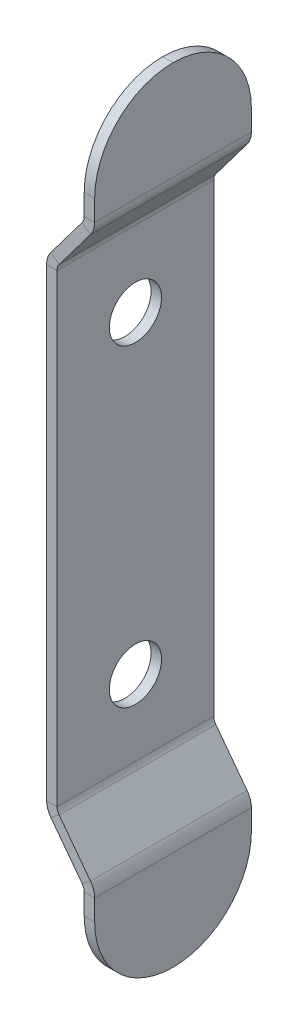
ISO-10303-21;
HEADER;
FILE_DESCRIPTION(('STEP AP214'),'2;1');
FILE_NAME('part.step','',(''),(''),'','','');
FILE_SCHEMA(('AUTOMOTIVE_DESIGN { 1 0 10303 214 1 1 1 1 }'));
ENDSEC;
DATA;
#1=APPLICATION_CONTEXT('core data for automotive mechanical design processes');
#2=APPLICATION_PROTOCOL_DEFINITION('international standard','automotive_design',2000,#1);
#3=PRODUCT_CONTEXT('',#1,'mechanical');
#4=PRODUCT('Part','Part','',(#3));
#5=PRODUCT_RELATED_PRODUCT_CATEGORY('part','',(#4));
#6=PRODUCT_DEFINITION_FORMATION('','',#4);
#7=PRODUCT_DEFINITION_CONTEXT('part definition',#1,'design');
#8=PRODUCT_DEFINITION('design','',#6,#7);
#9=PRODUCT_DEFINITION_SHAPE('','',#8);
#10=(LENGTH_UNIT() NAMED_UNIT(*) SI_UNIT(.MILLI.,.METRE.));
#11=(NAMED_UNIT(*) PLANE_ANGLE_UNIT() SI_UNIT($,.RADIAN.));
#12=(NAMED_UNIT(*) SI_UNIT($,.STERADIAN.) SOLID_ANGLE_UNIT());
#13=UNCERTAINTY_MEASURE_WITH_UNIT(LENGTH_MEASURE(1.E-05),#10,'distance_accuracy_value','');
#14=(GEOMETRIC_REPRESENTATION_CONTEXT(3) GLOBAL_UNCERTAINTY_ASSIGNED_CONTEXT((#13)) GLOBAL_UNIT_ASSIGNED_CONTEXT((#10,
#11,#12)) REPRESENTATION_CONTEXT('',''));
#15=CARTESIAN_POINT('',(0.,0.,0.));
#16=DIRECTION('',(0.,0.,1.));
#17=DIRECTION('',(1.,0.,0.));
#18=AXIS2_PLACEMENT_3D('',#15,#16,#17);
#19=CARTESIAN_POINT('',(-6.48170725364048,5.5,1.5));
#20=DIRECTION('',(0.,0.,-1.));
#21=DIRECTION('',(-1.,0.,0.));
#22=AXIS2_PLACEMENT_3D('',#19,#20,#21);
#23=PLANE('',#22);
#24=DIRECTION('',(0.,1.,0.));
#25=VECTOR('',#24,1.);
#26=CARTESIAN_POINT('',(0.82,5.49999999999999,1.5));
#27=LINE('',#26,#25);
#28=CARTESIAN_POINT('',(0.82,5.60037859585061,1.49999999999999));
#29=VERTEX_POINT('',#28);
#30=CARTESIAN_POINT('',(0.82,5.99999999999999,1.5));
#31=VERTEX_POINT('',#30);
#32=EDGE_CURVE('E419',#29,#31,#27,.T.);
#33=ORIENTED_EDGE('',*,*,#32,.T.);
#34=DIRECTION('',(1.,0.,0.));
#35=VECTOR('',#34,1.);
#36=CARTESIAN_POINT('',(-6.48170725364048,6.,1.5));
#37=LINE('',#36,#35);
#38=CARTESIAN_POINT('',(0.62,5.99999999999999,1.5));
#39=VERTEX_POINT('',#38);
#40=EDGE_CURVE('E219',#31,#39,#37,.F.);
#41=ORIENTED_EDGE('',*,*,#40,.T.);
#42=DIRECTION('',(0.,1.,0.));
#43=VECTOR('',#42,1.);
#44=CARTESIAN_POINT('',(0.62,5.49999999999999,1.5));
#45=LINE('',#44,#43);
#46=CARTESIAN_POINT('',(0.619999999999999,5.60037859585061,1.5));
#47=VERTEX_POINT('',#46);
#48=EDGE_CURVE('E194',#47,#39,#45,.T.);
#49=ORIENTED_EDGE('',*,*,#48,.F.);
#50=DIRECTION('',(1.,0.,0.));
#51=VECTOR('',#50,1.);
#52=CARTESIAN_POINT('',(-6.48170725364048,5.60037859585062,1.49999999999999));
#53=LINE('',#52,#51);
#54=EDGE_CURVE('E204',#47,#29,#53,.T.);
#55=ORIENTED_EDGE('',*,*,#54,.T.);
#56=EDGE_LOOP('',(#33,#41,#49,#55));
#57=FACE_BOUND('',#56,.T.);
#58=ADVANCED_FACE('F24',(#57),#23,.F.);
#59=CARTESIAN_POINT('',(-6.48170725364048,5.50000000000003,-1.5));
#60=DIRECTION('',(0.,0.,-1.));
#61=DIRECTION('',(-1.,0.,0.));
#62=AXIS2_PLACEMENT_3D('',#59,#60,#61);
#63=PLANE('',#62);
#64=DIRECTION('',(0.,1.,0.));
#65=VECTOR('',#64,1.);
#66=CARTESIAN_POINT('',(0.62,5.50000000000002,-1.5));
#67=LINE('',#66,#65);
#68=CARTESIAN_POINT('',(0.619999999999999,5.60037859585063,-1.5));
#69=VERTEX_POINT('',#68);
#70=CARTESIAN_POINT('',(0.62,6.00000000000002,-1.5));
#71=VERTEX_POINT('',#70);
#72=EDGE_CURVE('E197',#69,#71,#67,.T.);
#73=ORIENTED_EDGE('',*,*,#72,.T.);
#74=DIRECTION('',(1.,0.,0.));
#75=VECTOR('',#74,1.);
#76=CARTESIAN_POINT('',(0.82,6.00000000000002,-1.5));
#77=LINE('',#76,#75);
#78=CARTESIAN_POINT('',(0.82,6.00000000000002,-1.5));
#79=VERTEX_POINT('',#78);
#80=EDGE_CURVE('E225',#71,#79,#77,.T.);
#81=ORIENTED_EDGE('',*,*,#80,.T.);
#82=DIRECTION('',(0.,1.,0.));
#83=VECTOR('',#82,1.);
#84=CARTESIAN_POINT('',(0.82,5.50000000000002,-1.5));
#85=LINE('',#84,#83);
#86=CARTESIAN_POINT('',(0.819999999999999,5.60037859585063,-1.5));
#87=VERTEX_POINT('',#86);
#88=EDGE_CURVE('E203',#87,#79,#85,.T.);
#89=ORIENTED_EDGE('',*,*,#88,.F.);
#90=DIRECTION('',(1.,0.,0.));
#91=VECTOR('',#90,1.);
#92=CARTESIAN_POINT('',(-6.48170725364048,5.60037859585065,-1.50000000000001));
#93=LINE('',#92,#91);
#94=EDGE_CURVE('E176',#69,#87,#93,.T.);
#95=ORIENTED_EDGE('',*,*,#94,.F.);
#96=EDGE_LOOP('',(#73,#81,#89,#95));
#97=FACE_BOUND('',#96,.T.);
#98=ADVANCED_FACE('F207',(#97),#63,.T.);
#99=CARTESIAN_POINT('',(0.62,5.49999999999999,1.5));
#100=DIRECTION('',(-1.,0.,0.));
#101=DIRECTION('',(0.,-1.,0.));
#102=AXIS2_PLACEMENT_3D('',#99,#100,#101);
#103=PLANE('',#102);
#104=ORIENTED_EDGE('',*,*,#48,.T.);
#105=CARTESIAN_POINT('',(0.62,6.,0.));
#106=DIRECTION('',(-1.,0.,0.));
#107=DIRECTION('',(0.,-1.,0.));
#108=AXIS2_PLACEMENT_3D('',#105,#106,#107);
#109=CIRCLE('',#108,1.5);
#110=CARTESIAN_POINT('',(0.62,7.5,0.));
#111=VERTEX_POINT('',#110);
#112=EDGE_CURVE('E223',#39,#111,#109,.T.);
#113=ORIENTED_EDGE('',*,*,#112,.T.);
#114=CARTESIAN_POINT('',(0.62,6.,0.));
#115=DIRECTION('',(-1.,0.,0.));
#116=DIRECTION('',(0.,-1.,0.));
#117=AXIS2_PLACEMENT_3D('',#114,#115,#116);
#118=CIRCLE('',#117,1.5);
#119=EDGE_CURVE('E200',#111,#71,#118,.T.);
#120=ORIENTED_EDGE('',*,*,#119,.T.);
#121=ORIENTED_EDGE('',*,*,#72,.F.);
#122=DIRECTION('',(0.,0.,-1.));
#123=VECTOR('',#122,1.);
#124=CARTESIAN_POINT('',(0.62,5.60037859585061,1.49999999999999));
#125=LINE('',#124,#123);
#126=EDGE_CURVE('E187',#47,#69,#125,.T.);
#127=ORIENTED_EDGE('',*,*,#126,.F.);
#128=EDGE_LOOP('',(#104,#113,#120,#121,#127));
#129=FACE_BOUND('',#128,.T.);
#130=ADVANCED_FACE('F198',(#129),#103,.T.);
#131=CARTESIAN_POINT('',(0.82,5.49999999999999,1.5));
#132=DIRECTION('',(-1.,0.,0.));
#133=DIRECTION('',(0.,-1.,0.));
#134=AXIS2_PLACEMENT_3D('',#131,#132,#133);
#135=PLANE('',#134);
#136=CARTESIAN_POINT('',(0.82,6.,0.));
#137=DIRECTION('',(-1.,0.,0.));
#138=DIRECTION('',(0.,-1.,0.));
#139=AXIS2_PLACEMENT_3D('',#136,#137,#138);
#140=CIRCLE('',#139,1.5);
#141=CARTESIAN_POINT('',(0.82,7.5,0.));
#142=VERTEX_POINT('',#141);
#143=EDGE_CURVE('E215',#79,#142,#140,.F.);
#144=ORIENTED_EDGE('',*,*,#143,.T.);
#145=CARTESIAN_POINT('',(0.82,6.,0.));
#146=DIRECTION('',(-1.,0.,0.));
#147=DIRECTION('',(0.,-1.,0.));
#148=AXIS2_PLACEMENT_3D('',#145,#146,#147);
#149=CIRCLE('',#148,1.5);
#150=EDGE_CURVE('E217',#142,#31,#149,.F.);
#151=ORIENTED_EDGE('',*,*,#150,.T.);
#152=ORIENTED_EDGE('',*,*,#32,.F.);
#153=DIRECTION('',(0.,0.,-1.));
#154=VECTOR('',#153,1.);
#155=CARTESIAN_POINT('',(0.82,5.60037859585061,1.49999999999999));
#156=LINE('',#155,#154);
#157=EDGE_CURVE('E422',#29,#87,#156,.T.);
#158=ORIENTED_EDGE('',*,*,#157,.T.);
#159=ORIENTED_EDGE('',*,*,#88,.T.);
#160=EDGE_LOOP('',(#144,#151,#152,#158,#159));
#161=FACE_BOUND('',#160,.T.);
#162=ADVANCED_FACE('F435',(#161),#135,.F.);
#163=CARTESIAN_POINT('',(5.68894479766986,1.75563152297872,1.5));
#164=DIRECTION('',(0.,0.,1.));
#165=DIRECTION('',(0.798635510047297,-0.601815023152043,0.));
#166=AXIS2_PLACEMENT_3D('',#163,#164,#165);
#167=PLANE('',#166);
#168=DIRECTION('',(-0.798635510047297,0.601815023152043,0.));
#169=VECTOR('',#168,1.);
#170=CARTESIAN_POINT('',(5.62853545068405,1.67546561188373,1.5));
#171=LINE('',#170,#169);
#172=CARTESIAN_POINT('',(0.73945420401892,5.35965258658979,1.5));
#173=VERTEX_POINT('',#172);
#174=CARTESIAN_POINT('',(0.579727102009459,5.4800155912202,1.5));
#175=VERTEX_POINT('',#174);
#176=EDGE_CURVE('E411',#173,#175,#171,.T.);
#177=ORIENTED_EDGE('',*,*,#176,.T.);
#178=DIRECTION('',(0.601815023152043,0.798635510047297,0.));
#179=VECTOR('',#178,1.);
#180=CARTESIAN_POINT('',(0.64013644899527,5.56018150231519,1.49999999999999));
#181=LINE('',#180,#179);
#182=CARTESIAN_POINT('',(-0.0194542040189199,4.68487514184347,1.5));
#183=VERTEX_POINT('',#182);
#184=EDGE_CURVE('E389',#183,#175,#181,.T.);
#185=ORIENTED_EDGE('',*,*,#184,.F.);
#186=DIRECTION('',(-0.798635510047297,0.601815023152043,0.));
#187=VECTOR('',#186,1.);
#188=CARTESIAN_POINT('',(5.02935414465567,0.880325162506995,1.5));
#189=LINE('',#188,#187);
#190=CARTESIAN_POINT('',(0.14027289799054,4.56451213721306,1.5));
#191=VERTEX_POINT('',#190);
#192=EDGE_CURVE('E409',#191,#183,#189,.T.);
#193=ORIENTED_EDGE('',*,*,#192,.F.);
#194=DIRECTION('',(0.601815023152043,0.798635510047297,0.));
#195=VECTOR('',#194,1.);
#196=CARTESIAN_POINT('',(0.799863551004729,5.43981849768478,1.5));
#197=LINE('',#196,#195);
#198=EDGE_CURVE('E397',#191,#173,#197,.T.);
#199=ORIENTED_EDGE('',*,*,#198,.T.);
#200=EDGE_LOOP('',(#177,#185,#193,#199));
#201=FACE_BOUND('',#200,.T.);
#202=ADVANCED_FACE('F447',(#201),#167,.T.);
#203=CARTESIAN_POINT('',(5.68894479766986,1.75563152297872,-1.5));
#204=DIRECTION('',(0.,0.,1.));
#205=DIRECTION('',(0.798635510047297,-0.601815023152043,0.));
#206=AXIS2_PLACEMENT_3D('',#203,#204,#205);
#207=PLANE('',#206);
#208=DIRECTION('',(-0.601815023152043,-0.798635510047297,0.));
#209=VECTOR('',#208,1.);
#210=CARTESIAN_POINT('',(0.64013644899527,5.56018150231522,-1.50000000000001));
#211=LINE('',#210,#209);
#212=CARTESIAN_POINT('',(0.579727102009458,5.48001559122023,-1.5));
#213=VERTEX_POINT('',#212);
#214=CARTESIAN_POINT('',(-0.0194542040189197,4.6848751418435,-1.5));
#215=VERTEX_POINT('',#214);
#216=EDGE_CURVE('E416',#213,#215,#211,.T.);
#217=ORIENTED_EDGE('',*,*,#216,.F.);
#218=DIRECTION('',(-0.798635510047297,0.601815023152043,0.));
#219=VECTOR('',#218,1.);
#220=CARTESIAN_POINT('',(5.62853545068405,1.67546561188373,-1.5));
#221=LINE('',#220,#219);
#222=CARTESIAN_POINT('',(0.739454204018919,5.35965258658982,-1.5));
#223=VERTEX_POINT('',#222);
#224=EDGE_CURVE('E179',#223,#213,#221,.T.);
#225=ORIENTED_EDGE('',*,*,#224,.F.);
#226=DIRECTION('',(-0.601815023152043,-0.798635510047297,0.));
#227=VECTOR('',#226,1.);
#228=CARTESIAN_POINT('',(0.799863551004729,5.43981849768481,-1.5));
#229=LINE('',#228,#227);
#230=CARTESIAN_POINT('',(0.14027289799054,4.56451213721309,-1.5));
#231=VERTEX_POINT('',#230);
#232=EDGE_CURVE('E413',#223,#231,#229,.T.);
#233=ORIENTED_EDGE('',*,*,#232,.T.);
#234=DIRECTION('',(-0.798635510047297,0.601815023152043,0.));
#235=VECTOR('',#234,1.);
#236=CARTESIAN_POINT('',(5.02935414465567,0.880325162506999,-1.5));
#237=LINE('',#236,#235);
#238=EDGE_CURVE('E406',#231,#215,#237,.T.);
#239=ORIENTED_EDGE('',*,*,#238,.T.);
#240=EDGE_LOOP('',(#217,#225,#233,#239));
#241=FACE_BOUND('',#240,.T.);
#242=ADVANCED_FACE('F476',(#241),#207,.F.);
#243=CARTESIAN_POINT('',(0.799863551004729,5.43981849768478,1.5));
#244=DIRECTION('',(-0.798635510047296,0.601815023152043,0.));
#245=DIRECTION('',(-0.601815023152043,-0.798635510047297,0.));
#246=AXIS2_PLACEMENT_3D('',#243,#244,#245);
#247=PLANE('',#246);
#248=ORIENTED_EDGE('',*,*,#232,.F.);
#249=DIRECTION('',(0.,0.,1.));
#250=VECTOR('',#249,1.);
#251=CARTESIAN_POINT('',(0.739454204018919,5.35965258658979,1.5));
#252=LINE('',#251,#250);
#253=EDGE_CURVE('E403',#223,#173,#252,.T.);
#254=ORIENTED_EDGE('',*,*,#253,.T.);
#255=ORIENTED_EDGE('',*,*,#198,.F.);
#256=DIRECTION('',(0.,0.,-1.));
#257=VECTOR('',#256,1.);
#258=CARTESIAN_POINT('',(0.14027289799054,4.5645121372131,-1.5));
#259=LINE('',#258,#257);
#260=EDGE_CURVE('E400',#191,#231,#259,.T.);
#261=ORIENTED_EDGE('',*,*,#260,.T.);
#262=EDGE_LOOP('',(#248,#254,#255,#261));
#263=FACE_BOUND('',#262,.T.);
#264=ADVANCED_FACE('F443',(#263),#247,.F.);
#265=CARTESIAN_POINT('',(0.64013644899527,5.56018150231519,1.49999999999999));
#266=DIRECTION('',(-0.798635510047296,0.601815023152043,0.));
#267=DIRECTION('',(-0.601815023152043,-0.798635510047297,0.));
#268=AXIS2_PLACEMENT_3D('',#265,#266,#267);
#269=PLANE('',#268);
#270=DIRECTION('',(0.,0.,1.));
#271=VECTOR('',#270,1.);
#272=CARTESIAN_POINT('',(0.579727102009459,5.4800155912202,1.5));
#273=LINE('',#272,#271);
#274=EDGE_CURVE('E395',#213,#175,#273,.T.);
#275=ORIENTED_EDGE('',*,*,#274,.F.);
#276=ORIENTED_EDGE('',*,*,#216,.T.);
#277=DIRECTION('',(0.,0.,-1.));
#278=VECTOR('',#277,1.);
#279=CARTESIAN_POINT('',(-0.0194542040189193,4.6848751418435,-1.5));
#280=LINE('',#279,#278);
#281=EDGE_CURVE('E392',#183,#215,#280,.T.);
#282=ORIENTED_EDGE('',*,*,#281,.F.);
#283=ORIENTED_EDGE('',*,*,#184,.T.);
#284=EDGE_LOOP('',(#275,#276,#282,#283));
#285=FACE_BOUND('',#284,.T.);
#286=ADVANCED_FACE('F482',(#285),#269,.T.);
#287=CARTESIAN_POINT('',(-6.48170725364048,-5.49999999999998,-1.5));
#288=DIRECTION('',(0.,0.,-1.));
#289=DIRECTION('',(-1.,0.,0.));
#290=AXIS2_PLACEMENT_3D('',#287,#288,#289);
#291=PLANE('',#290);
#292=DIRECTION('',(0.,1.,0.));
#293=VECTOR('',#292,1.);
#294=CARTESIAN_POINT('',(0.820000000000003,-5.49999999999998,-1.5));
#295=LINE('',#294,#293);
#296=CARTESIAN_POINT('',(0.820000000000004,-5.99999999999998,-1.5));
#297=VERTEX_POINT('',#296);
#298=CARTESIAN_POINT('',(0.820000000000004,-5.6003785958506,-1.49999999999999));
#299=VERTEX_POINT('',#298);
#300=EDGE_CURVE('E377',#297,#299,#295,.T.);
#301=ORIENTED_EDGE('',*,*,#300,.F.);
#302=DIRECTION('',(1.,0.,0.));
#303=VECTOR('',#302,1.);
#304=CARTESIAN_POINT('',(-6.48170725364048,-5.99999999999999,-1.5));
#305=LINE('',#304,#303);
#306=CARTESIAN_POINT('',(0.620000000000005,-5.99999999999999,-1.5));
#307=VERTEX_POINT('',#306);
#308=EDGE_CURVE('E11',#297,#307,#305,.F.);
#309=ORIENTED_EDGE('',*,*,#308,.T.);
#310=DIRECTION('',(0.,1.,0.));
#311=VECTOR('',#310,1.);
#312=CARTESIAN_POINT('',(0.620000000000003,-5.49999999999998,-1.5));
#313=LINE('',#312,#311);
#314=CARTESIAN_POINT('',(0.620000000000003,-5.6003785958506,-1.49999999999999));
#315=VERTEX_POINT('',#314);
#316=EDGE_CURVE('E250',#307,#315,#313,.T.);
#317=ORIENTED_EDGE('',*,*,#316,.T.);
#318=DIRECTION('',(1.,0.,0.));
#319=VECTOR('',#318,1.);
#320=CARTESIAN_POINT('',(-6.48170725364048,-5.60037859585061,-1.49999999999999));
#321=LINE('',#320,#319);
#322=EDGE_CURVE('E386',#315,#299,#321,.T.);
#323=ORIENTED_EDGE('',*,*,#322,.T.);
#324=EDGE_LOOP('',(#301,#309,#317,#323));
#325=FACE_BOUND('',#324,.T.);
#326=ADVANCED_FACE('F485',(#325),#291,.T.);
#327=CARTESIAN_POINT('',(-6.48170725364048,-5.50000000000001,1.5));
#328=DIRECTION('',(0.,0.,-1.));
#329=DIRECTION('',(-1.,0.,0.));
#330=AXIS2_PLACEMENT_3D('',#327,#328,#329);
#331=PLANE('',#330);
#332=DIRECTION('',(0.,1.,0.));
#333=VECTOR('',#332,1.);
#334=CARTESIAN_POINT('',(0.620000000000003,-5.50000000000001,1.5));
#335=LINE('',#334,#333);
#336=CARTESIAN_POINT('',(0.620000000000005,-6.00000000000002,1.5));
#337=VERTEX_POINT('',#336);
#338=CARTESIAN_POINT('',(0.620000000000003,-5.60037859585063,1.50000000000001));
#339=VERTEX_POINT('',#338);
#340=EDGE_CURVE('E238',#337,#339,#335,.T.);
#341=ORIENTED_EDGE('',*,*,#340,.F.);
#342=DIRECTION('',(1.,0.,0.));
#343=VECTOR('',#342,1.);
#344=CARTESIAN_POINT('',(0.820000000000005,-6.00000000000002,1.5));
#345=LINE('',#344,#343);
#346=CARTESIAN_POINT('',(0.820000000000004,-6.00000000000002,1.5));
#347=VERTEX_POINT('',#346);
#348=EDGE_CURVE('E227',#337,#347,#345,.T.);
#349=ORIENTED_EDGE('',*,*,#348,.T.);
#350=DIRECTION('',(0.,1.,0.));
#351=VECTOR('',#350,1.);
#352=CARTESIAN_POINT('',(0.820000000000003,-5.50000000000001,1.5));
#353=LINE('',#352,#351);
#354=CARTESIAN_POINT('',(0.820000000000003,-5.60037859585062,1.50000000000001));
#355=VERTEX_POINT('',#354);
#356=EDGE_CURVE('E258',#347,#355,#353,.T.);
#357=ORIENTED_EDGE('',*,*,#356,.T.);
#358=DIRECTION('',(1.,0.,0.));
#359=VECTOR('',#358,1.);
#360=CARTESIAN_POINT('',(-6.48170725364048,-5.60037859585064,1.50000000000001));
#361=LINE('',#360,#359);
#362=EDGE_CURVE('E248',#339,#355,#361,.T.);
#363=ORIENTED_EDGE('',*,*,#362,.F.);
#364=EDGE_LOOP('',(#341,#349,#357,#363));
#365=FACE_BOUND('',#364,.T.);
#366=ADVANCED_FACE('F245',(#365),#331,.F.);
#367=CARTESIAN_POINT('',(0.620000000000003,-5.50000000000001,1.5));
#368=DIRECTION('',(-1.,0.,0.));
#369=DIRECTION('',(0.,-1.,0.));
#370=AXIS2_PLACEMENT_3D('',#367,#368,#369);
#371=PLANE('',#370);
#372=CARTESIAN_POINT('',(0.620000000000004,-6.,0.));
#373=DIRECTION('',(-1.,0.,0.));
#374=DIRECTION('',(0.,-1.,0.));
#375=AXIS2_PLACEMENT_3D('',#372,#373,#374);
#376=CIRCLE('',#375,1.5);
#377=CARTESIAN_POINT('',(0.620000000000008,-7.5,0.));
#378=VERTEX_POINT('',#377);
#379=EDGE_CURVE('E38',#307,#378,#376,.T.);
#380=ORIENTED_EDGE('',*,*,#379,.T.);
#381=CARTESIAN_POINT('',(0.620000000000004,-6.,0.));
#382=DIRECTION('',(-1.,0.,0.));
#383=DIRECTION('',(0.,-1.,0.));
#384=AXIS2_PLACEMENT_3D('',#381,#382,#383);
#385=CIRCLE('',#384,1.5);
#386=EDGE_CURVE('E31',#378,#337,#385,.T.);
#387=ORIENTED_EDGE('',*,*,#386,.T.);
#388=ORIENTED_EDGE('',*,*,#340,.T.);
#389=DIRECTION('',(0.,0.,1.));
#390=VECTOR('',#389,1.);
#391=CARTESIAN_POINT('',(0.620000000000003,-5.6003785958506,-1.49999999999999));
#392=LINE('',#391,#390);
#393=EDGE_CURVE('E249',#315,#339,#392,.T.);
#394=ORIENTED_EDGE('',*,*,#393,.F.);
#395=ORIENTED_EDGE('',*,*,#316,.F.);
#396=EDGE_LOOP('',(#380,#387,#388,#394,#395));
#397=FACE_BOUND('',#396,.T.);
#398=ADVANCED_FACE('F236',(#397),#371,.T.);
#399=CARTESIAN_POINT('',(0.820000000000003,-5.50000000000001,1.5));
#400=DIRECTION('',(-1.,0.,0.));
#401=DIRECTION('',(0.,-1.,0.));
#402=AXIS2_PLACEMENT_3D('',#399,#400,#401);
#403=PLANE('',#402);
#404=ORIENTED_EDGE('',*,*,#356,.F.);
#405=CARTESIAN_POINT('',(0.820000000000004,-6.,0.));
#406=DIRECTION('',(-1.,0.,0.));
#407=DIRECTION('',(0.,-1.,0.));
#408=AXIS2_PLACEMENT_3D('',#405,#406,#407);
#409=CIRCLE('',#408,1.5);
#410=CARTESIAN_POINT('',(0.820000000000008,-7.5,0.));
#411=VERTEX_POINT('',#410);
#412=EDGE_CURVE('E232',#347,#411,#409,.F.);
#413=ORIENTED_EDGE('',*,*,#412,.T.);
#414=CARTESIAN_POINT('',(0.820000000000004,-6.,0.));
#415=DIRECTION('',(-1.,0.,0.));
#416=DIRECTION('',(0.,-1.,0.));
#417=AXIS2_PLACEMENT_3D('',#414,#415,#416);
#418=CIRCLE('',#417,1.5);
#419=EDGE_CURVE('E230',#411,#297,#418,.F.);
#420=ORIENTED_EDGE('',*,*,#419,.T.);
#421=ORIENTED_EDGE('',*,*,#300,.T.);
#422=DIRECTION('',(0.,0.,1.));
#423=VECTOR('',#422,1.);
#424=CARTESIAN_POINT('',(0.820000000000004,-5.6003785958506,-1.49999999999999));
#425=LINE('',#424,#423);
#426=EDGE_CURVE('E380',#299,#355,#425,.T.);
#427=ORIENTED_EDGE('',*,*,#426,.T.);
#428=EDGE_LOOP('',(#404,#413,#420,#421,#427));
#429=FACE_BOUND('',#428,.T.);
#430=ADVANCED_FACE('F256',(#429),#403,.F.);
#431=CARTESIAN_POINT('',(5.68894479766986,-1.75563152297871,-1.5));
#432=DIRECTION('',(0.,0.,1.));
#433=DIRECTION('',(0.798635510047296,0.601815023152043,0.));
#434=AXIS2_PLACEMENT_3D('',#431,#432,#433);
#435=PLANE('',#434);
#436=DIRECTION('',(-0.601815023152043,0.798635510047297,0.));
#437=VECTOR('',#436,1.);
#438=CARTESIAN_POINT('',(0.640136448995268,-5.56018150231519,-1.49999999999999));
#439=LINE('',#438,#437);
#440=CARTESIAN_POINT('',(0.579727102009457,-5.4800155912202,-1.5));
#441=VERTEX_POINT('',#440);
#442=CARTESIAN_POINT('',(-0.0194542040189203,-4.68487514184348,-1.5));
#443=VERTEX_POINT('',#442);
#444=EDGE_CURVE('E343',#441,#443,#439,.T.);
#445=ORIENTED_EDGE('',*,*,#444,.T.);
#446=DIRECTION('',(-0.798635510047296,-0.601815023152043,0.));
#447=VECTOR('',#446,1.);
#448=CARTESIAN_POINT('',(5.02935414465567,-0.880325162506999,-1.5));
#449=LINE('',#448,#447);
#450=CARTESIAN_POINT('',(0.140272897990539,-4.56451213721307,-1.5));
#451=VERTEX_POINT('',#450);
#452=EDGE_CURVE('E367',#451,#443,#449,.T.);
#453=ORIENTED_EDGE('',*,*,#452,.F.);
#454=DIRECTION('',(-0.601815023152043,0.798635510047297,0.));
#455=VECTOR('',#454,1.);
#456=CARTESIAN_POINT('',(0.799863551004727,-5.43981849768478,-1.5));
#457=LINE('',#456,#455);
#458=CARTESIAN_POINT('',(0.739454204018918,-5.35965258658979,-1.5));
#459=VERTEX_POINT('',#458);
#460=EDGE_CURVE('E352',#459,#451,#457,.T.);
#461=ORIENTED_EDGE('',*,*,#460,.F.);
#462=DIRECTION('',(-0.798635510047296,-0.601815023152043,0.));
#463=VECTOR('',#462,1.);
#464=CARTESIAN_POINT('',(5.62853545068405,-1.67546561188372,-1.5));
#465=LINE('',#464,#463);
#466=EDGE_CURVE('E369',#459,#441,#465,.T.);
#467=ORIENTED_EDGE('',*,*,#466,.T.);
#468=EDGE_LOOP('',(#445,#453,#461,#467));
#469=FACE_BOUND('',#468,.T.);
#470=ADVANCED_FACE('F495',(#469),#435,.F.);
#471=CARTESIAN_POINT('',(5.68894479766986,-1.75563152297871,1.5));
#472=DIRECTION('',(0.,0.,1.));
#473=DIRECTION('',(0.798635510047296,0.601815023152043,0.));
#474=AXIS2_PLACEMENT_3D('',#471,#472,#473);
#475=PLANE('',#474);
#476=DIRECTION('',(-0.798635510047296,-0.601815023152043,0.));
#477=VECTOR('',#476,1.);
#478=CARTESIAN_POINT('',(5.02935414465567,-0.880325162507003,1.5));
#479=LINE('',#478,#477);
#480=CARTESIAN_POINT('',(0.140272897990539,-4.5645121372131,1.50000000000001));
#481=VERTEX_POINT('',#480);
#482=CARTESIAN_POINT('',(-0.0194542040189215,-4.68487514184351,1.5));
#483=VERTEX_POINT('',#482);
#484=EDGE_CURVE('E364',#481,#483,#479,.T.);
#485=ORIENTED_EDGE('',*,*,#484,.T.);
#486=DIRECTION('',(0.601815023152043,-0.798635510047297,0.));
#487=VECTOR('',#486,1.);
#488=CARTESIAN_POINT('',(0.640136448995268,-5.56018150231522,1.50000000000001));
#489=LINE('',#488,#487);
#490=CARTESIAN_POINT('',(0.579727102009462,-5.48001559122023,1.50000000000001));
#491=VERTEX_POINT('',#490);
#492=EDGE_CURVE('E375',#483,#491,#489,.T.);
#493=ORIENTED_EDGE('',*,*,#492,.T.);
#494=DIRECTION('',(-0.798635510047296,-0.601815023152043,0.));
#495=VECTOR('',#494,1.);
#496=CARTESIAN_POINT('',(5.62853545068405,-1.67546561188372,1.5));
#497=LINE('',#496,#495);
#498=CARTESIAN_POINT('',(0.739454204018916,-5.35965258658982,1.5));
#499=VERTEX_POINT('',#498);
#500=EDGE_CURVE('E361',#499,#491,#497,.T.);
#501=ORIENTED_EDGE('',*,*,#500,.F.);
#502=DIRECTION('',(0.601815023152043,-0.798635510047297,0.));
#503=VECTOR('',#502,1.);
#504=CARTESIAN_POINT('',(0.799863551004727,-5.43981849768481,1.5));
#505=LINE('',#504,#503);
#506=EDGE_CURVE('E372',#481,#499,#505,.T.);
#507=ORIENTED_EDGE('',*,*,#506,.F.);
#508=EDGE_LOOP('',(#485,#493,#501,#507));
#509=FACE_BOUND('',#508,.T.);
#510=ADVANCED_FACE('F498',(#509),#475,.T.);
#511=CARTESIAN_POINT('',(0.799863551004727,-5.43981849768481,1.5));
#512=DIRECTION('',(-0.798635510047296,-0.601815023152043,0.));
#513=DIRECTION('',(0.601815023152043,-0.798635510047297,0.));
#514=AXIS2_PLACEMENT_3D('',#511,#512,#513);
#515=PLANE('',#514);
#516=ORIENTED_EDGE('',*,*,#506,.T.);
#517=DIRECTION('',(0.,0.,-1.));
#518=VECTOR('',#517,1.);
#519=CARTESIAN_POINT('',(0.739454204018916,-5.35965258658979,-1.5));
#520=LINE('',#519,#518);
#521=EDGE_CURVE('E358',#499,#459,#520,.T.);
#522=ORIENTED_EDGE('',*,*,#521,.T.);
#523=ORIENTED_EDGE('',*,*,#460,.T.);
#524=DIRECTION('',(0.,0.,1.));
#525=VECTOR('',#524,1.);
#526=CARTESIAN_POINT('',(0.140272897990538,-4.5645121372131,1.5));
#527=LINE('',#526,#525);
#528=EDGE_CURVE('E355',#451,#481,#527,.T.);
#529=ORIENTED_EDGE('',*,*,#528,.T.);
#530=EDGE_LOOP('',(#516,#522,#523,#529));
#531=FACE_BOUND('',#530,.T.);
#532=ADVANCED_FACE('F502',(#531),#515,.F.);
#533=CARTESIAN_POINT('',(0.640136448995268,-5.56018150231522,1.50000000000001));
#534=DIRECTION('',(-0.798635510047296,-0.601815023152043,0.));
#535=DIRECTION('',(0.601815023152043,-0.798635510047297,0.));
#536=AXIS2_PLACEMENT_3D('',#533,#534,#535);
#537=PLANE('',#536);
#538=DIRECTION('',(0.,0.,-1.));
#539=VECTOR('',#538,1.);
#540=CARTESIAN_POINT('',(0.579727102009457,-5.4800155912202,-1.5));
#541=LINE('',#540,#539);
#542=EDGE_CURVE('E349',#491,#441,#541,.T.);
#543=ORIENTED_EDGE('',*,*,#542,.F.);
#544=ORIENTED_EDGE('',*,*,#492,.F.);
#545=DIRECTION('',(0.,0.,1.));
#546=VECTOR('',#545,1.);
#547=CARTESIAN_POINT('',(-0.0194542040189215,-4.68487514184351,1.5));
#548=LINE('',#547,#546);
#549=EDGE_CURVE('E346',#443,#483,#548,.T.);
#550=ORIENTED_EDGE('',*,*,#549,.F.);
#551=ORIENTED_EDGE('',*,*,#444,.F.);
#552=EDGE_LOOP('',(#543,#544,#550,#551));
#553=FACE_BOUND('',#552,.T.);
#554=ADVANCED_FACE('F506',(#553),#537,.T.);
#555=CARTESIAN_POINT('',(18.6618598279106,4.5445277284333,-1.5));
#556=DIRECTION('',(0.,0.,1.));
#557=DIRECTION('',(1.,0.,0.));
#558=AXIS2_PLACEMENT_3D('',#555,#556,#557);
#559=PLANE('',#558);
#560=DIRECTION('',(0.,1.,0.));
#561=VECTOR('',#560,1.);
#562=CARTESIAN_POINT('',(-0.1,4.54452772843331,-1.5));
#563=LINE('',#562,#561);
#564=CARTESIAN_POINT('',(-0.0999999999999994,-4.44414913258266,-1.5));
#565=VERTEX_POINT('',#564);
#566=CARTESIAN_POINT('',(-0.1,4.44414913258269,-1.5));
#567=VERTEX_POINT('',#566);
#568=EDGE_CURVE('E309',#565,#567,#563,.T.);
#569=ORIENTED_EDGE('',*,*,#568,.T.);
#570=DIRECTION('',(-1.,0.,0.));
#571=VECTOR('',#570,1.);
#572=CARTESIAN_POINT('',(18.6618598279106,4.44414913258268,-1.5));
#573=LINE('',#572,#571);
#574=CARTESIAN_POINT('',(0.0999999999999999,4.44414913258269,-1.5));
#575=VERTEX_POINT('',#574);
#576=EDGE_CURVE('E335',#575,#567,#573,.T.);
#577=ORIENTED_EDGE('',*,*,#576,.F.);
#578=DIRECTION('',(0.,1.,0.));
#579=VECTOR('',#578,1.);
#580=CARTESIAN_POINT('',(0.0999999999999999,4.54452772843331,-1.5));
#581=LINE('',#580,#579);
#582=CARTESIAN_POINT('',(0.0999999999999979,-4.44414913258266,-1.5));
#583=VERTEX_POINT('',#582);
#584=EDGE_CURVE('E318',#583,#575,#581,.T.);
#585=ORIENTED_EDGE('',*,*,#584,.F.);
#586=DIRECTION('',(-1.,0.,0.));
#587=VECTOR('',#586,1.);
#588=CARTESIAN_POINT('',(18.6618598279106,-4.44414913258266,-1.5));
#589=LINE('',#588,#587);
#590=EDGE_CURVE('E327',#583,#565,#589,.T.);
#591=ORIENTED_EDGE('',*,*,#590,.T.);
#592=EDGE_LOOP('',(#569,#577,#585,#591));
#593=FACE_BOUND('',#592,.T.);
#594=ADVANCED_FACE('F510',(#593),#559,.F.);
#595=CARTESIAN_POINT('',(18.6618598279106,4.54452772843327,1.5));
#596=DIRECTION('',(0.,0.,1.));
#597=DIRECTION('',(1.,0.,0.));
#598=AXIS2_PLACEMENT_3D('',#595,#596,#597);
#599=PLANE('',#598);
#600=DIRECTION('',(-1.,0.,0.));
#601=VECTOR('',#600,1.);
#602=CARTESIAN_POINT('',(18.6618598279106,4.44414913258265,1.5));
#603=LINE('',#602,#601);
#604=CARTESIAN_POINT('',(0.0999999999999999,4.44414913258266,1.5));
#605=VERTEX_POINT('',#604);
#606=CARTESIAN_POINT('',(-0.0999999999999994,4.44414913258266,1.5));
#607=VERTEX_POINT('',#606);
#608=EDGE_CURVE('E332',#605,#607,#603,.T.);
#609=ORIENTED_EDGE('',*,*,#608,.T.);
#610=DIRECTION('',(0.,1.,0.));
#611=VECTOR('',#610,1.);
#612=CARTESIAN_POINT('',(-0.1,4.54452772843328,1.5));
#613=LINE('',#612,#611);
#614=CARTESIAN_POINT('',(-0.100000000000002,-4.44414913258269,1.50000000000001));
#615=VERTEX_POINT('',#614);
#616=EDGE_CURVE('E312',#615,#607,#613,.T.);
#617=ORIENTED_EDGE('',*,*,#616,.F.);
#618=DIRECTION('',(-1.,0.,0.));
#619=VECTOR('',#618,1.);
#620=CARTESIAN_POINT('',(18.6618598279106,-4.44414913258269,1.5));
#621=LINE('',#620,#619);
#622=CARTESIAN_POINT('',(0.0999999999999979,-4.44414913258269,1.50000000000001));
#623=VERTEX_POINT('',#622);
#624=EDGE_CURVE('E330',#623,#615,#621,.T.);
#625=ORIENTED_EDGE('',*,*,#624,.F.);
#626=DIRECTION('',(0.,1.,0.));
#627=VECTOR('',#626,1.);
#628=CARTESIAN_POINT('',(0.0999999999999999,4.54452772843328,1.5));
#629=LINE('',#628,#627);
#630=EDGE_CURVE('E321',#623,#605,#629,.T.);
#631=ORIENTED_EDGE('',*,*,#630,.T.);
#632=EDGE_LOOP('',(#609,#617,#625,#631));
#633=FACE_BOUND('',#632,.T.);
#634=ADVANCED_FACE('F514',(#633),#599,.T.);
#635=CARTESIAN_POINT('',(0.0999999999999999,4.54452772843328,1.5));
#636=DIRECTION('',(-1.,0.,0.));
#637=DIRECTION('',(0.,-1.,0.));
#638=AXIS2_PLACEMENT_3D('',#635,#636,#637);
#639=PLANE('',#638);
#640=CARTESIAN_POINT('',(0.0999999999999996,2.99999999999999,0.));
#641=DIRECTION('',(1.,0.,0.));
#642=DIRECTION('',(0.,-1.,0.));
#643=AXIS2_PLACEMENT_3D('',#640,#641,#642);
#644=CIRCLE('',#643,0.5);
#645=CARTESIAN_POINT('',(0.0999999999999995,2.49999999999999,0.));
#646=VERTEX_POINT('',#645);
#647=EDGE_CURVE('E668',#646,#646,#644,.T.);
#648=ORIENTED_EDGE('',*,*,#647,.F.);
#649=EDGE_LOOP('',(#648));
#650=FACE_BOUND('',#649,.T.);
#651=CARTESIAN_POINT('',(0.0999999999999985,-3.00000000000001,0.));
#652=DIRECTION('',(1.,0.,0.));
#653=DIRECTION('',(0.,1.,0.));
#654=AXIS2_PLACEMENT_3D('',#651,#652,#653);
#655=CIRCLE('',#654,0.5);
#656=CARTESIAN_POINT('',(0.0999999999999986,-2.50000000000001,0.));
#657=VERTEX_POINT('',#656);
#658=EDGE_CURVE('E266',#657,#657,#655,.T.);
#659=ORIENTED_EDGE('',*,*,#658,.F.);
#660=EDGE_LOOP('',(#659));
#661=FACE_BOUND('',#660,.T.);
#662=DIRECTION('',(0.,0.,-1.));
#663=VECTOR('',#662,1.);
#664=CARTESIAN_POINT('',(0.0999999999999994,4.44414913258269,-1.5));
#665=LINE('',#664,#663);
#666=EDGE_CURVE('E324',#605,#575,#665,.T.);
#667=ORIENTED_EDGE('',*,*,#666,.F.);
#668=ORIENTED_EDGE('',*,*,#630,.F.);
#669=DIRECTION('',(0.,0.,1.));
#670=VECTOR('',#669,1.);
#671=CARTESIAN_POINT('',(0.0999999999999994,-4.44414913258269,1.5));
#672=LINE('',#671,#670);
#673=EDGE_CURVE('E337',#583,#623,#672,.T.);
#674=ORIENTED_EDGE('',*,*,#673,.F.);
#675=ORIENTED_EDGE('',*,*,#584,.T.);
#676=EDGE_LOOP('',(#667,#668,#674,#675));
#677=FACE_BOUND('',#676,.T.);
#678=ADVANCED_FACE('F518',(#650,#661,#677),#639,.F.);
#679=CARTESIAN_POINT('',(-0.1,4.54452772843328,1.5));
#680=DIRECTION('',(-1.,0.,0.));
#681=DIRECTION('',(0.,-1.,0.));
#682=AXIS2_PLACEMENT_3D('',#679,#680,#681);
#683=PLANE('',#682);
#684=CARTESIAN_POINT('',(-0.100000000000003,2.99999999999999,0.));
#685=DIRECTION('',(1.,0.,0.));
#686=DIRECTION('',(0.,-1.,0.));
#687=AXIS2_PLACEMENT_3D('',#684,#685,#686);
#688=CIRCLE('',#687,0.5);
#689=CARTESIAN_POINT('',(-0.100000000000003,2.49999999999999,0.));
#690=VERTEX_POINT('',#689);
#691=EDGE_CURVE('E665',#690,#690,#688,.T.);
#692=ORIENTED_EDGE('',*,*,#691,.T.);
#693=EDGE_LOOP('',(#692));
#694=FACE_BOUND('',#693,.T.);
#695=CARTESIAN_POINT('',(-0.100000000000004,-3.00000000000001,0.));
#696=DIRECTION('',(1.,0.,0.));
#697=DIRECTION('',(0.,1.,0.));
#698=AXIS2_PLACEMENT_3D('',#695,#696,#697);
#699=CIRCLE('',#698,0.5);
#700=CARTESIAN_POINT('',(-0.100000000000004,-2.50000000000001,0.));
#701=VERTEX_POINT('',#700);
#702=EDGE_CURVE('E261',#701,#701,#699,.T.);
#703=ORIENTED_EDGE('',*,*,#702,.T.);
#704=EDGE_LOOP('',(#703));
#705=FACE_BOUND('',#704,.T.);
#706=ORIENTED_EDGE('',*,*,#616,.T.);
#707=DIRECTION('',(0.,0.,-1.));
#708=VECTOR('',#707,1.);
#709=CARTESIAN_POINT('',(-0.0999999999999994,4.44414913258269,-1.5));
#710=LINE('',#709,#708);
#711=EDGE_CURVE('E315',#607,#567,#710,.T.);
#712=ORIENTED_EDGE('',*,*,#711,.T.);
#713=ORIENTED_EDGE('',*,*,#568,.F.);
#714=DIRECTION('',(0.,0.,1.));
#715=VECTOR('',#714,1.);
#716=CARTESIAN_POINT('',(-0.0999999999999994,-4.44414913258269,1.5));
#717=LINE('',#716,#715);
#718=EDGE_CURVE('E340',#565,#615,#717,.T.);
#719=ORIENTED_EDGE('',*,*,#718,.T.);
#720=EDGE_LOOP('',(#706,#712,#713,#719));
#721=FACE_BOUND('',#720,.T.);
#722=ADVANCED_FACE('F522',(#694,#705,#721),#683,.T.);
#723=CARTESIAN_POINT('',(0.299999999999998,-4.44414913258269,1.50000000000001));
#724=DIRECTION('',(0.,0.,1.));
#725=DIRECTION('',(1.,0.,0.));
#726=AXIS2_PLACEMENT_3D('',#723,#724,#725);
#727=PLANE('',#726);
#728=ORIENTED_EDGE('',*,*,#484,.F.);
#729=CARTESIAN_POINT('',(0.299999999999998,-4.44414913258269,1.50000000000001));
#730=DIRECTION('',(0.,0.,-1.));
#731=DIRECTION('',(-1.,0.,0.));
#732=AXIS2_PLACEMENT_3D('',#729,#730,#731);
#733=CIRCLE('',#732,0.2);
#734=EDGE_CURVE('E298',#481,#623,#733,.T.);
#735=ORIENTED_EDGE('',*,*,#734,.T.);
#736=ORIENTED_EDGE('',*,*,#624,.T.);
#737=CARTESIAN_POINT('',(0.299999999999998,-4.44414913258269,1.50000000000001));
#738=DIRECTION('',(0.,0.,-1.));
#739=DIRECTION('',(-1.,0.,0.));
#740=AXIS2_PLACEMENT_3D('',#737,#738,#739);
#741=CIRCLE('',#740,0.4);
#742=EDGE_CURVE('E303',#483,#615,#741,.T.);
#743=ORIENTED_EDGE('',*,*,#742,.F.);
#744=EDGE_LOOP('',(#728,#735,#736,#743));
#745=FACE_BOUND('',#744,.T.);
#746=ADVANCED_FACE('F526',(#745),#727,.T.);
#747=CARTESIAN_POINT('',(0.299999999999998,-4.44414913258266,-1.5));
#748=DIRECTION('',(0.,0.,-1.));
#749=DIRECTION('',(-1.,0.,0.));
#750=AXIS2_PLACEMENT_3D('',#747,#748,#749);
#751=PLANE('',#750);
#752=CARTESIAN_POINT('',(0.299999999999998,-4.44414913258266,-1.5));
#753=DIRECTION('',(0.,0.,-1.));
#754=DIRECTION('',(-1.,0.,0.));
#755=AXIS2_PLACEMENT_3D('',#752,#753,#754);
#756=CIRCLE('',#755,0.2);
#757=EDGE_CURVE('E300',#583,#451,#756,.F.);
#758=ORIENTED_EDGE('',*,*,#757,.T.);
#759=ORIENTED_EDGE('',*,*,#452,.T.);
#760=CARTESIAN_POINT('',(0.299999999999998,-4.44414913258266,-1.5));
#761=DIRECTION('',(0.,0.,-1.));
#762=DIRECTION('',(-1.,0.,0.));
#763=AXIS2_PLACEMENT_3D('',#760,#761,#762);
#764=CIRCLE('',#763,0.4);
#765=EDGE_CURVE('E306',#565,#443,#764,.F.);
#766=ORIENTED_EDGE('',*,*,#765,.F.);
#767=ORIENTED_EDGE('',*,*,#590,.F.);
#768=EDGE_LOOP('',(#758,#759,#766,#767));
#769=FACE_BOUND('',#768,.T.);
#770=ADVANCED_FACE('F528',(#769),#751,.T.);
#771=CARTESIAN_POINT('',(0.299999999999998,-4.44414913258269,17.243484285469));
#772=DIRECTION('',(0.,0.,-1.));
#773=DIRECTION('',(-1.,0.,0.));
#774=AXIS2_PLACEMENT_3D('',#771,#772,#773);
#775=CYLINDRICAL_SURFACE('',#774,0.4);
#776=ORIENTED_EDGE('',*,*,#718,.F.);
#777=ORIENTED_EDGE('',*,*,#765,.T.);
#778=ORIENTED_EDGE('',*,*,#549,.T.);
#779=ORIENTED_EDGE('',*,*,#742,.T.);
#780=EDGE_LOOP('',(#776,#777,#778,#779));
#781=FACE_BOUND('',#780,.T.);
#782=ADVANCED_FACE('F531',(#781),#775,.T.);
#783=CARTESIAN_POINT('',(0.299999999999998,-4.44414913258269,17.243484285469));
#784=DIRECTION('',(0.,0.,-1.));
#785=DIRECTION('',(-1.,0.,0.));
#786=AXIS2_PLACEMENT_3D('',#783,#784,#785);
#787=CYLINDRICAL_SURFACE('',#786,0.2);
#788=ORIENTED_EDGE('',*,*,#673,.T.);
#789=ORIENTED_EDGE('',*,*,#734,.F.);
#790=ORIENTED_EDGE('',*,*,#528,.F.);
#791=ORIENTED_EDGE('',*,*,#757,.F.);
#792=EDGE_LOOP('',(#788,#789,#790,#791));
#793=FACE_BOUND('',#792,.T.);
#794=ADVANCED_FACE('F533',(#793),#787,.F.);
#795=CARTESIAN_POINT('',(0.420000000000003,-5.60037859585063,1.50000000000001));
#796=DIRECTION('',(0.,0.,-1.));
#797=DIRECTION('',(-1.,0.,0.));
#798=AXIS2_PLACEMENT_3D('',#795,#796,#797);
#799=PLANE('',#798);
#800=ORIENTED_EDGE('',*,*,#500,.T.);
#801=CARTESIAN_POINT('',(0.420000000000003,-5.60037859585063,1.50000000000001));
#802=DIRECTION('',(0.,0.,1.));
#803=DIRECTION('',(1.,0.,0.));
#804=AXIS2_PLACEMENT_3D('',#801,#802,#803);
#805=CIRCLE('',#804,0.2);
#806=EDGE_CURVE('E286',#339,#491,#805,.T.);
#807=ORIENTED_EDGE('',*,*,#806,.F.);
#808=ORIENTED_EDGE('',*,*,#362,.T.);
#809=CARTESIAN_POINT('',(0.420000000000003,-5.60037859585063,1.50000000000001));
#810=DIRECTION('',(0.,0.,1.));
#811=DIRECTION('',(1.,0.,0.));
#812=AXIS2_PLACEMENT_3D('',#809,#810,#811);
#813=CIRCLE('',#812,0.4);
#814=EDGE_CURVE('E292',#355,#499,#813,.T.);
#815=ORIENTED_EDGE('',*,*,#814,.T.);
#816=EDGE_LOOP('',(#800,#807,#808,#815));
#817=FACE_BOUND('',#816,.T.);
#818=ADVANCED_FACE('F542',(#817),#799,.F.);
#819=CARTESIAN_POINT('',(0.420000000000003,-5.60037859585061,-1.49999999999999));
#820=DIRECTION('',(0.,0.,1.));
#821=DIRECTION('',(1.,0.,0.));
#822=AXIS2_PLACEMENT_3D('',#819,#820,#821);
#823=PLANE('',#822);
#824=CARTESIAN_POINT('',(0.420000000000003,-5.60037859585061,-1.49999999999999));
#825=DIRECTION('',(0.,0.,1.));
#826=DIRECTION('',(1.,0.,0.));
#827=AXIS2_PLACEMENT_3D('',#824,#825,#826);
#828=CIRCLE('',#827,0.2);
#829=EDGE_CURVE('E289',#441,#315,#828,.F.);
#830=ORIENTED_EDGE('',*,*,#829,.F.);
#831=ORIENTED_EDGE('',*,*,#466,.F.);
#832=CARTESIAN_POINT('',(0.420000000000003,-5.60037859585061,-1.49999999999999));
#833=DIRECTION('',(0.,0.,1.));
#834=DIRECTION('',(1.,0.,0.));
#835=AXIS2_PLACEMENT_3D('',#832,#833,#834);
#836=CIRCLE('',#835,0.4);
#837=EDGE_CURVE('E295',#459,#299,#836,.F.);
#838=ORIENTED_EDGE('',*,*,#837,.T.);
#839=ORIENTED_EDGE('',*,*,#322,.F.);
#840=EDGE_LOOP('',(#830,#831,#838,#839));
#841=FACE_BOUND('',#840,.T.);
#842=ADVANCED_FACE('F544',(#841),#823,.F.);
#843=CARTESIAN_POINT('',(0.420000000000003,-5.60037859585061,-16.8226171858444));
#844=DIRECTION('',(0.,0.,1.));
#845=DIRECTION('',(1.,0.,0.));
#846=AXIS2_PLACEMENT_3D('',#843,#844,#845);
#847=CYLINDRICAL_SURFACE('',#846,0.4);
#848=ORIENTED_EDGE('',*,*,#426,.F.);
#849=ORIENTED_EDGE('',*,*,#837,.F.);
#850=ORIENTED_EDGE('',*,*,#521,.F.);
#851=ORIENTED_EDGE('',*,*,#814,.F.);
#852=EDGE_LOOP('',(#848,#849,#850,#851));
#853=FACE_BOUND('',#852,.T.);
#854=ADVANCED_FACE('F547',(#853),#847,.T.);
#855=CARTESIAN_POINT('',(0.420000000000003,-5.60037859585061,-16.8226171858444));
#856=DIRECTION('',(0.,0.,1.));
#857=DIRECTION('',(1.,0.,0.));
#858=AXIS2_PLACEMENT_3D('',#855,#856,#857);
#859=CYLINDRICAL_SURFACE('',#858,0.2);
#860=ORIENTED_EDGE('',*,*,#393,.T.);
#861=ORIENTED_EDGE('',*,*,#806,.T.);
#862=ORIENTED_EDGE('',*,*,#542,.T.);
#863=ORIENTED_EDGE('',*,*,#829,.T.);
#864=EDGE_LOOP('',(#860,#861,#862,#863));
#865=FACE_BOUND('',#864,.T.);
#866=ADVANCED_FACE('F549',(#865),#859,.F.);
#867=CARTESIAN_POINT('',(0.3,4.44414913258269,-1.5));
#868=DIRECTION('',(0.,0.,-1.));
#869=DIRECTION('',(-1.,0.,0.));
#870=AXIS2_PLACEMENT_3D('',#867,#868,#869);
#871=PLANE('',#870);
#872=ORIENTED_EDGE('',*,*,#238,.F.);
#873=CARTESIAN_POINT('',(0.3,4.44414913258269,-1.5));
#874=DIRECTION('',(0.,0.,1.));
#875=DIRECTION('',(1.,0.,0.));
#876=AXIS2_PLACEMENT_3D('',#873,#874,#875);
#877=CIRCLE('',#876,0.2);
#878=EDGE_CURVE('E275',#231,#575,#877,.T.);
#879=ORIENTED_EDGE('',*,*,#878,.T.);
#880=ORIENTED_EDGE('',*,*,#576,.T.);
#881=CARTESIAN_POINT('',(0.3,4.44414913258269,-1.5));
#882=DIRECTION('',(0.,0.,1.));
#883=DIRECTION('',(1.,0.,0.));
#884=AXIS2_PLACEMENT_3D('',#881,#882,#883);
#885=CIRCLE('',#884,0.4);
#886=EDGE_CURVE('E280',#215,#567,#885,.T.);
#887=ORIENTED_EDGE('',*,*,#886,.F.);
#888=EDGE_LOOP('',(#872,#879,#880,#887));
#889=FACE_BOUND('',#888,.T.);
#890=ADVANCED_FACE('F558',(#889),#871,.T.);
#891=CARTESIAN_POINT('',(0.3,4.44414913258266,1.5));
#892=DIRECTION('',(0.,0.,1.));
#893=DIRECTION('',(1.,0.,0.));
#894=AXIS2_PLACEMENT_3D('',#891,#892,#893);
#895=PLANE('',#894);
#896=CARTESIAN_POINT('',(0.3,4.44414913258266,1.5));
#897=DIRECTION('',(0.,0.,1.));
#898=DIRECTION('',(1.,0.,0.));
#899=AXIS2_PLACEMENT_3D('',#896,#897,#898);
#900=CIRCLE('',#899,0.2);
#901=EDGE_CURVE('E277',#605,#191,#900,.F.);
#902=ORIENTED_EDGE('',*,*,#901,.T.);
#903=ORIENTED_EDGE('',*,*,#192,.T.);
#904=CARTESIAN_POINT('',(0.3,4.44414913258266,1.5));
#905=DIRECTION('',(0.,0.,1.));
#906=DIRECTION('',(1.,0.,0.));
#907=AXIS2_PLACEMENT_3D('',#904,#905,#906);
#908=CIRCLE('',#907,0.4);
#909=EDGE_CURVE('E283',#607,#183,#908,.F.);
#910=ORIENTED_EDGE('',*,*,#909,.F.);
#911=ORIENTED_EDGE('',*,*,#608,.F.);
#912=EDGE_LOOP('',(#902,#903,#910,#911));
#913=FACE_BOUND('',#912,.T.);
#914=ADVANCED_FACE('F560',(#913),#895,.T.);
#915=CARTESIAN_POINT('',(0.3,4.4441491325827,-17.0468191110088));
#916=DIRECTION('',(0.,0.,1.));
#917=DIRECTION('',(1.,0.,0.));
#918=AXIS2_PLACEMENT_3D('',#915,#916,#917);
#919=CYLINDRICAL_SURFACE('',#918,0.4);
#920=ORIENTED_EDGE('',*,*,#711,.F.);
#921=ORIENTED_EDGE('',*,*,#909,.T.);
#922=ORIENTED_EDGE('',*,*,#281,.T.);
#923=ORIENTED_EDGE('',*,*,#886,.T.);
#924=EDGE_LOOP('',(#920,#921,#922,#923));
#925=FACE_BOUND('',#924,.T.);
#926=ADVANCED_FACE('F563',(#925),#919,.T.);
#927=CARTESIAN_POINT('',(0.3,4.4441491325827,-17.0468191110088));
#928=DIRECTION('',(0.,0.,1.));
#929=DIRECTION('',(1.,0.,0.));
#930=AXIS2_PLACEMENT_3D('',#927,#928,#929);
#931=CYLINDRICAL_SURFACE('',#930,0.2);
#932=ORIENTED_EDGE('',*,*,#666,.T.);
#933=ORIENTED_EDGE('',*,*,#878,.F.);
#934=ORIENTED_EDGE('',*,*,#260,.F.);
#935=ORIENTED_EDGE('',*,*,#901,.F.);
#936=EDGE_LOOP('',(#932,#933,#934,#935));
#937=FACE_BOUND('',#936,.T.);
#938=ADVANCED_FACE('F458',(#937),#931,.F.);
#939=CARTESIAN_POINT('',(0.419999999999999,5.60037859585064,-1.50000000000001));
#940=DIRECTION('',(0.,0.,1.));
#941=DIRECTION('',(1.,0.,0.));
#942=AXIS2_PLACEMENT_3D('',#939,#940,#941);
#943=PLANE('',#942);
#944=ORIENTED_EDGE('',*,*,#224,.T.);
#945=CARTESIAN_POINT('',(0.419999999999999,5.60037859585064,-1.5));
#946=DIRECTION('',(0.,0.,-1.));
#947=DIRECTION('',(-1.,0.,0.));
#948=AXIS2_PLACEMENT_3D('',#945,#946,#947);
#949=CIRCLE('',#948,0.2);
#950=EDGE_CURVE('E171',#69,#213,#949,.T.);
#951=ORIENTED_EDGE('',*,*,#950,.F.);
#952=ORIENTED_EDGE('',*,*,#94,.T.);
#953=CARTESIAN_POINT('',(0.419999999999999,5.60037859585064,-1.5));
#954=DIRECTION('',(0.,0.,-1.));
#955=DIRECTION('',(-1.,0.,0.));
#956=AXIS2_PLACEMENT_3D('',#953,#954,#955);
#957=CIRCLE('',#956,0.4);
#958=EDGE_CURVE('E271',#87,#223,#957,.T.);
#959=ORIENTED_EDGE('',*,*,#958,.T.);
#960=EDGE_LOOP('',(#944,#951,#952,#959));
#961=FACE_BOUND('',#960,.T.);
#962=ADVANCED_FACE('F173',(#961),#943,.F.);
#963=CARTESIAN_POINT('',(0.419999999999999,5.60037859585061,1.49999999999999));
#964=DIRECTION('',(0.,0.,-1.));
#965=DIRECTION('',(-1.,0.,0.));
#966=AXIS2_PLACEMENT_3D('',#963,#964,#965);
#967=PLANE('',#966);
#968=CARTESIAN_POINT('',(0.419999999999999,5.60037859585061,1.5));
#969=DIRECTION('',(0.,0.,-1.));
#970=DIRECTION('',(-1.,0.,0.));
#971=AXIS2_PLACEMENT_3D('',#968,#969,#970);
#972=CIRCLE('',#971,0.2);
#973=EDGE_CURVE('E182',#175,#47,#972,.F.);
#974=ORIENTED_EDGE('',*,*,#973,.F.);
#975=ORIENTED_EDGE('',*,*,#176,.F.);
#976=CARTESIAN_POINT('',(0.419999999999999,5.60037859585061,1.5));
#977=DIRECTION('',(0.,0.,-1.));
#978=DIRECTION('',(-1.,0.,0.));
#979=AXIS2_PLACEMENT_3D('',#976,#977,#978);
#980=CIRCLE('',#979,0.4);
#981=EDGE_CURVE('E273',#173,#29,#980,.F.);
#982=ORIENTED_EDGE('',*,*,#981,.T.);
#983=ORIENTED_EDGE('',*,*,#54,.F.);
#984=EDGE_LOOP('',(#974,#975,#982,#983));
#985=FACE_BOUND('',#984,.T.);
#986=ADVANCED_FACE('F450',(#985),#967,.F.);
#987=CARTESIAN_POINT('',(0.419999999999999,5.60037859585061,16.6024295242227));
#988=DIRECTION('',(0.,0.,-1.));
#989=DIRECTION('',(-1.,0.,0.));
#990=AXIS2_PLACEMENT_3D('',#987,#988,#989);
#991=CYLINDRICAL_SURFACE('',#990,0.4);
#992=ORIENTED_EDGE('',*,*,#157,.F.);
#993=ORIENTED_EDGE('',*,*,#981,.F.);
#994=ORIENTED_EDGE('',*,*,#253,.F.);
#995=ORIENTED_EDGE('',*,*,#958,.F.);
#996=EDGE_LOOP('',(#992,#993,#994,#995));
#997=FACE_BOUND('',#996,.T.);
#998=ADVANCED_FACE('F439',(#997),#991,.T.);
#999=CARTESIAN_POINT('',(0.419999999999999,5.60037859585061,16.6024295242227));
#1000=DIRECTION('',(0.,0.,-1.));
#1001=DIRECTION('',(-1.,0.,0.));
#1002=AXIS2_PLACEMENT_3D('',#999,#1000,#1001);
#1003=CYLINDRICAL_SURFACE('',#1002,0.2);
#1004=ORIENTED_EDGE('',*,*,#126,.T.);
#1005=ORIENTED_EDGE('',*,*,#950,.T.);
#1006=ORIENTED_EDGE('',*,*,#274,.T.);
#1007=ORIENTED_EDGE('',*,*,#973,.T.);
#1008=EDGE_LOOP('',(#1004,#1005,#1006,#1007));
#1009=FACE_BOUND('',#1008,.T.);
#1010=ADVANCED_FACE('F189',(#1009),#1003,.F.);
#1011=CARTESIAN_POINT('',(-6.48170725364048,6.00000000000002,0.));
#1012=DIRECTION('',(-1.,0.,0.));
#1013=DIRECTION('',(0.,-1.,0.));
#1014=AXIS2_PLACEMENT_3D('',#1011,#1012,#1013);
#1015=CYLINDRICAL_SURFACE('',#1014,1.5);
#1016=ORIENTED_EDGE('',*,*,#80,.F.);
#1017=ORIENTED_EDGE('',*,*,#119,.F.);
#1018=DIRECTION('',(1.,0.,0.));
#1019=VECTOR('',#1018,1.);
#1020=CARTESIAN_POINT('',(0.62,7.5,0.));
#1021=LINE('',#1020,#1019);
#1022=EDGE_CURVE('E183',#142,#111,#1021,.F.);
#1023=ORIENTED_EDGE('',*,*,#1022,.F.);
#1024=ORIENTED_EDGE('',*,*,#143,.F.);
#1025=EDGE_LOOP('',(#1016,#1017,#1023,#1024));
#1026=FACE_BOUND('',#1025,.T.);
#1027=ADVANCED_FACE('F433',(#1026),#1015,.T.);
#1028=CARTESIAN_POINT('',(-6.48170725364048,6.00000000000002,0.));
#1029=DIRECTION('',(1.,0.,0.));
#1030=DIRECTION('',(0.,1.,0.));
#1031=AXIS2_PLACEMENT_3D('',#1028,#1029,#1030);
#1032=CYLINDRICAL_SURFACE('',#1031,1.5);
#1033=ORIENTED_EDGE('',*,*,#112,.F.);
#1034=ORIENTED_EDGE('',*,*,#40,.F.);
#1035=ORIENTED_EDGE('',*,*,#150,.F.);
#1036=ORIENTED_EDGE('',*,*,#1022,.T.);
#1037=EDGE_LOOP('',(#1033,#1034,#1035,#1036));
#1038=FACE_BOUND('',#1037,.T.);
#1039=ADVANCED_FACE('F429',(#1038),#1032,.T.);
#1040=CARTESIAN_POINT('',(-6.48170725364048,-6.,0.));
#1041=DIRECTION('',(1.,0.,0.));
#1042=DIRECTION('',(0.,1.,0.));
#1043=AXIS2_PLACEMENT_3D('',#1040,#1041,#1042);
#1044=CYLINDRICAL_SURFACE('',#1043,1.5);
#1045=DIRECTION('',(1.,0.,0.));
#1046=VECTOR('',#1045,1.);
#1047=CARTESIAN_POINT('',(-6.48170725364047,-7.5,0.));
#1048=LINE('',#1047,#1046);
#1049=EDGE_CURVE('E253',#378,#411,#1048,.T.);
#1050=ORIENTED_EDGE('',*,*,#1049,.F.);
#1051=ORIENTED_EDGE('',*,*,#379,.F.);
#1052=ORIENTED_EDGE('',*,*,#308,.F.);
#1053=ORIENTED_EDGE('',*,*,#419,.F.);
#1054=EDGE_LOOP('',(#1050,#1051,#1052,#1053));
#1055=FACE_BOUND('',#1054,.T.);
#1056=ADVANCED_FACE('F260',(#1055),#1044,.T.);
#1057=CARTESIAN_POINT('',(-6.48170725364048,-6.,0.));
#1058=DIRECTION('',(-1.,0.,0.));
#1059=DIRECTION('',(0.,-1.,0.));
#1060=AXIS2_PLACEMENT_3D('',#1057,#1058,#1059);
#1061=CYLINDRICAL_SURFACE('',#1060,1.5);
#1062=ORIENTED_EDGE('',*,*,#386,.F.);
#1063=ORIENTED_EDGE('',*,*,#1049,.T.);
#1064=ORIENTED_EDGE('',*,*,#412,.F.);
#1065=ORIENTED_EDGE('',*,*,#348,.F.);
#1066=EDGE_LOOP('',(#1062,#1063,#1064,#1065));
#1067=FACE_BOUND('',#1066,.T.);
#1068=ADVANCED_FACE('F252',(#1067),#1061,.T.);
#1069=CARTESIAN_POINT('',(-0.100000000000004,-3.00000000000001,0.));
#1070=DIRECTION('',(1.,0.,0.));
#1071=DIRECTION('',(0.,1.,0.));
#1072=AXIS2_PLACEMENT_3D('',#1069,#1070,#1071);
#1073=CYLINDRICAL_SURFACE('',#1072,0.5);
#1074=ORIENTED_EDGE('',*,*,#702,.F.);
#1075=EDGE_LOOP('',(#1074));
#1076=FACE_BOUND('',#1075,.T.);
#1077=ORIENTED_EDGE('',*,*,#658,.T.);
#1078=EDGE_LOOP('',(#1077));
#1079=FACE_BOUND('',#1078,.T.);
#1080=ADVANCED_FACE('F645',(#1076,#1079),#1073,.F.);
#1081=CARTESIAN_POINT('',(-0.100000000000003,2.99999999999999,0.));
#1082=DIRECTION('',(1.,0.,0.));
#1083=DIRECTION('',(0.,1.,0.));
#1084=AXIS2_PLACEMENT_3D('',#1081,#1082,#1083);
#1085=CYLINDRICAL_SURFACE('',#1084,0.5);
#1086=ORIENTED_EDGE('',*,*,#691,.F.);
#1087=EDGE_LOOP('',(#1086));
#1088=FACE_BOUND('',#1087,.T.);
#1089=ORIENTED_EDGE('',*,*,#647,.T.);
#1090=EDGE_LOOP('',(#1089));
#1091=FACE_BOUND('',#1090,.T.);
#1092=ADVANCED_FACE('F652',(#1088,#1091),#1085,.F.);
#1093=CLOSED_SHELL('',(#58,#98,#130,#162,#202,#242,#264,#286,#326,#366,#398,#430,#470,#510,#532,
#554,#594,#634,#678,#722,#746,#770,#782,#794,#818,#842,#854,#866,#890,#914,#926,#938,#962,#986,
#998,#1010,#1027,#1039,#1056,#1068,#1080,#1092));
#1094=MANIFOLD_SOLID_BREP('B2',#1093);
#1095=ADVANCED_BREP_SHAPE_REPRESENTATION('',(#18,#1094),#14);
#1096=SHAPE_DEFINITION_REPRESENTATION(#9,#1095);
ENDSEC;
END-ISO-10303-21;
